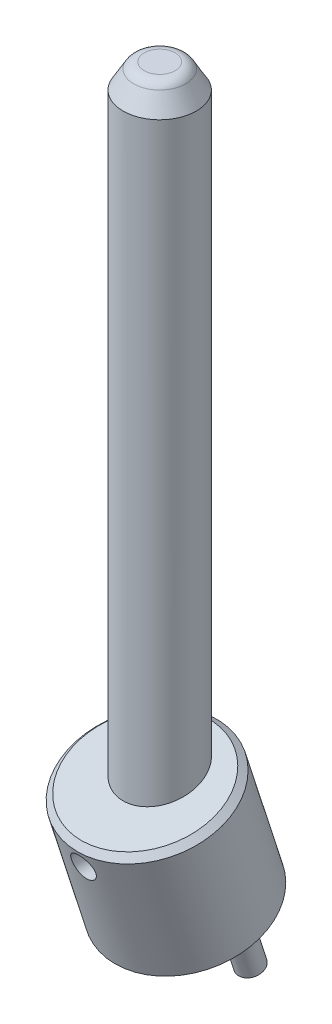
ISO-10303-21;
HEADER;
FILE_DESCRIPTION(('STEP AP214'),'2;1');
FILE_NAME('part.step','',(''),(''),'','','');
FILE_SCHEMA(('AUTOMOTIVE_DESIGN { 1 0 10303 214 1 1 1 1 }'));
ENDSEC;
DATA;
#1=APPLICATION_CONTEXT('core data for automotive mechanical design processes');
#2=APPLICATION_PROTOCOL_DEFINITION('international standard','automotive_design',2000,#1);
#3=PRODUCT_CONTEXT('',#1,'mechanical');
#4=PRODUCT('Part','Part','',(#3));
#5=PRODUCT_RELATED_PRODUCT_CATEGORY('part','',(#4));
#6=PRODUCT_DEFINITION_FORMATION('','',#4);
#7=PRODUCT_DEFINITION_CONTEXT('part definition',#1,'design');
#8=PRODUCT_DEFINITION('design','',#6,#7);
#9=PRODUCT_DEFINITION_SHAPE('','',#8);
#10=(LENGTH_UNIT() NAMED_UNIT(*) SI_UNIT(.MILLI.,.METRE.));
#11=(NAMED_UNIT(*) PLANE_ANGLE_UNIT() SI_UNIT($,.RADIAN.));
#12=(NAMED_UNIT(*) SI_UNIT($,.STERADIAN.) SOLID_ANGLE_UNIT());
#13=UNCERTAINTY_MEASURE_WITH_UNIT(LENGTH_MEASURE(1.E-05),#10,'distance_accuracy_value','');
#14=(GEOMETRIC_REPRESENTATION_CONTEXT(3) GLOBAL_UNCERTAINTY_ASSIGNED_CONTEXT((#13)) GLOBAL_UNIT_ASSIGNED_CONTEXT((#10,
#11,#12)) REPRESENTATION_CONTEXT('',''));
#15=CARTESIAN_POINT('',(0.,0.,0.));
#16=DIRECTION('',(0.,0.,1.));
#17=DIRECTION('',(1.,0.,0.));
#18=AXIS2_PLACEMENT_3D('',#15,#16,#17);
#19=CARTESIAN_POINT('',(0.,-9.40212494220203,-6.27483455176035));
#20=DIRECTION('',(0.,-0.951056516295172,-0.309016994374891));
#21=DIRECTION('',(0.,0.309016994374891,-0.951056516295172));
#22=AXIS2_PLACEMENT_3D('',#19,#20,#21);
#23=PLANE('',#22);
#24=CARTESIAN_POINT('',(-8.75,-9.40212494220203,-6.27483455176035));
#25=DIRECTION('',(0.,-0.951056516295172,-0.309016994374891));
#26=DIRECTION('',(0.,0.309016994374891,-0.951056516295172));
#27=AXIS2_PLACEMENT_3D('',#24,#25,#26);
#28=CIRCLE('',#27,1.49996275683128);
#29=CARTESIAN_POINT('',(-8.75,-8.93861095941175,-7.70138390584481));
#30=VERTEX_POINT('',#29);
#31=EDGE_CURVE('P0_E17',#30,#30,#28,.F.);
#32=ORIENTED_EDGE('',*,*,#31,.F.);
#33=EDGE_LOOP('',(#32));
#34=FACE_BOUND('',#33,.T.);
#35=ADVANCED_FACE('P0_F14',(#34),#23,.T.);
#36=CARTESIAN_POINT('',(0.,-9.40212494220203,-6.27483455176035));
#37=DIRECTION('',(0.,-0.951056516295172,-0.309016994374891));
#38=DIRECTION('',(0.,0.309016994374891,-0.951056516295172));
#39=AXIS2_PLACEMENT_3D('',#36,#37,#38);
#40=PLANE('',#39);
#41=CARTESIAN_POINT('',(8.75,-9.40212494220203,-6.27483455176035));
#42=DIRECTION('',(0.,-0.951056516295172,-0.309016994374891));
#43=DIRECTION('',(0.,0.309016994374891,-0.951056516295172));
#44=AXIS2_PLACEMENT_3D('',#41,#42,#43);
#45=CIRCLE('',#44,1.49996275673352);
#46=CARTESIAN_POINT('',(8.75,-8.93861095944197,-7.70138390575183));
#47=VERTEX_POINT('',#46);
#48=EDGE_CURVE('P0_E114',#47,#47,#45,.F.);
#49=ORIENTED_EDGE('',*,*,#48,.F.);
#50=EDGE_LOOP('',(#49));
#51=FACE_BOUND('',#50,.T.);
#52=ADVANCED_FACE('P0_F104',(#51),#40,.T.);
#53=CARTESIAN_POINT('',(0.,-1.96891114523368E-13,-3.84241249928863E-13));
#54=DIRECTION('',(0.,-1.,0.));
#55=DIRECTION('',(0.,0.,-1.));
#56=AXIS2_PLACEMENT_3D('',#53,#54,#55);
#57=PLANE('',#56);
#58=CARTESIAN_POINT('',(0.,1.21430643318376E-13,-2.23172175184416E-12));
#59=DIRECTION('',(0.,-1.,0.));
#60=DIRECTION('',(0.,0.,-1.));
#61=AXIS2_PLACEMENT_3D('',#58,#59,#60);
#62=CIRCLE('',#61,6.);
#63=CARTESIAN_POINT('',(0.,1.21430643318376E-13,-6.00000000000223));
#64=VERTEX_POINT('',#63);
#65=EDGE_CURVE('P0_E116',#64,#64,#62,.F.);
#66=ORIENTED_EDGE('',*,*,#65,.T.);
#67=EDGE_LOOP('',(#66));
#68=FACE_BOUND('',#67,.T.);
#69=ADVANCED_FACE('P0_F101',(#68),#57,.F.);
#70=CARTESIAN_POINT('',(-8.75,-8.92656978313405,-6.12031731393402));
#71=DIRECTION('',(0.,0.951056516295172,0.309016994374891));
#72=DIRECTION('',(0.,-0.309016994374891,0.951056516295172));
#73=AXIS2_PLACEMENT_3D('',#70,#71,#72);
#74=CONICAL_SURFACE('',#73,1.99997862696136,0.785385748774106);
#75=CARTESIAN_POINT('',(-8.75,-8.92654945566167,-6.12031070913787));
#76=DIRECTION('',(0.,0.951056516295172,0.309016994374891));
#77=DIRECTION('',(0.,-0.309016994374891,0.951056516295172));
#78=AXIS2_PLACEMENT_3D('',#75,#76,#77);
#79=CIRCLE('',#78,2.);
#80=CARTESIAN_POINT('',(-8.75,-9.54458344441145,-4.21819767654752));
#81=VERTEX_POINT('',#80);
#82=EDGE_CURVE('P0_E118',#81,#81,#79,.T.);
#83=ORIENTED_EDGE('',*,*,#82,.F.);
#84=EDGE_LOOP('',(#83));
#85=FACE_BOUND('',#84,.T.);
#86=ORIENTED_EDGE('',*,*,#31,.T.);
#87=EDGE_LOOP('',(#86));
#88=FACE_BOUND('',#87,.T.);
#89=ADVANCED_FACE('P0_F97',(#85,#88),#74,.T.);
#90=CARTESIAN_POINT('',(8.75,-8.92656978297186,-6.12031731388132));
#91=DIRECTION('',(0.,0.951056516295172,0.309016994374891));
#92=DIRECTION('',(0.,-0.309016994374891,0.951056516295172));
#93=AXIS2_PLACEMENT_3D('',#90,#91,#92);
#94=CONICAL_SURFACE('',#93,1.99997862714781,0.785385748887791);
#95=CARTESIAN_POINT('',(8.75,-8.92654945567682,-6.12031070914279));
#96=DIRECTION('',(0.,0.951056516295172,0.309016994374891));
#97=DIRECTION('',(0.,-0.309016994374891,0.951056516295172));
#98=AXIS2_PLACEMENT_3D('',#95,#96,#97);
#99=CIRCLE('',#98,2.);
#100=CARTESIAN_POINT('',(8.75,-9.5445834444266,-4.21819767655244));
#101=VERTEX_POINT('',#100);
#102=EDGE_CURVE('P0_E123',#101,#101,#99,.T.);
#103=ORIENTED_EDGE('',*,*,#102,.F.);
#104=EDGE_LOOP('',(#103));
#105=FACE_BOUND('',#104,.T.);
#106=ORIENTED_EDGE('',*,*,#48,.T.);
#107=EDGE_LOOP('',(#106));
#108=FACE_BOUND('',#107,.T.);
#109=ADVANCED_FACE('P0_F92',(#105,#108),#94,.T.);
#110=CARTESIAN_POINT('',(0.,22.9396913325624,-2.23345647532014E-12));
#111=DIRECTION('',(0.,-1.,0.));
#112=DIRECTION('',(0.,0.,-1.));
#113=AXIS2_PLACEMENT_3D('',#110,#111,#112);
#114=CYLINDRICAL_SURFACE('',#113,6.);
#115=CARTESIAN_POINT('',(0.,18.0000000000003,-2.23345647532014E-12));
#116=DIRECTION('',(0.,0.951056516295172,0.309016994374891));
#117=DIRECTION('',(0.,-0.309016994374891,0.951056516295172));
#118=AXIS2_PLACEMENT_3D('',#115,#116,#117);
#119=ELLIPSE('',#118,6.30877334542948,6.);
#120=CARTESIAN_POINT('',(0.,16.0504818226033,5.99999999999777));
#121=VERTEX_POINT('',#120);
#122=EDGE_CURVE('P0_E79',#121,#121,#119,.F.);
#123=ORIENTED_EDGE('',*,*,#122,.F.);
#124=EDGE_LOOP('',(#123));
#125=FACE_BOUND('',#124,.T.);
#126=ORIENTED_EDGE('',*,*,#65,.F.);
#127=EDGE_LOOP('',(#126));
#128=FACE_BOUND('',#127,.T.);
#129=CARTESIAN_POINT('',(0.,11.9999999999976,5.99999999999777));
#130=CARTESIAN_POINT('',(-0.108974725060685,11.9999938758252,5.99999564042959));
#131=CARTESIAN_POINT('',(-0.218061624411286,11.9910518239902,5.99699891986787));
#132=CARTESIAN_POINT('',(-0.433135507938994,11.9555850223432,5.9853189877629));
#133=CARTESIAN_POINT('',(-0.539117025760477,11.9290310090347,5.97662631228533));
#134=CARTESIAN_POINT('',(-0.744677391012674,11.8593554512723,5.95450405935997));
#135=CARTESIAN_POINT('',(-0.844270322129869,11.816271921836,5.94108535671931));
#136=CARTESIAN_POINT('',(-1.03478027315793,11.7148991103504,5.91088362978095));
#137=CARTESIAN_POINT('',(-1.12569835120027,11.6566116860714,5.89410101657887));
#138=CARTESIAN_POINT('',(-1.29948066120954,11.5243501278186,5.85828234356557));
#139=CARTESIAN_POINT('',(-1.3820029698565,11.4499414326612,5.83919212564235));
#140=CARTESIAN_POINT('',(-1.53366185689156,11.2884702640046,5.80120729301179));
#141=CARTESIAN_POINT('',(-1.60279478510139,11.2014043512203,5.78231273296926));
#142=CARTESIAN_POINT('',(-1.72765000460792,11.0140295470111,5.74626660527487));
#143=CARTESIAN_POINT('',(-1.78292996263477,10.9134120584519,5.72918070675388));
#144=CARTESIAN_POINT('',(-1.87563792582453,10.7036473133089,5.69950605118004));
#145=CARTESIAN_POINT('',(-1.91307145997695,10.5945027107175,5.68691590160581));
#146=CARTESIAN_POINT('',(-1.96774691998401,10.3746535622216,5.66822606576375));
#147=CARTESIAN_POINT('',(-1.98562689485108,10.2641255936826,5.66192191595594));
#148=CARTESIAN_POINT('',(-2.00268224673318,10.0414725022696,5.65591313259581));
#149=CARTESIAN_POINT('',(-2.00186340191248,9.92934788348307,5.6562064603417));
#150=CARTESIAN_POINT('',(-1.98203983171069,9.71212698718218,5.66318029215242));
#151=CARTESIAN_POINT('',(-1.96386791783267,9.60694368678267,5.66956828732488));
#152=CARTESIAN_POINT('',(-1.9112124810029,9.40121363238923,5.68753310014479));
#153=CARTESIAN_POINT('',(-1.87672692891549,9.30066745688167,5.69911056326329));
#154=CARTESIAN_POINT('',(-1.79187699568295,9.10517186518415,5.72635859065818));
#155=CARTESIAN_POINT('',(-1.74126547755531,9.01033887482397,5.74209216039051));
#156=CARTESIAN_POINT('',(-1.62577463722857,8.83025359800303,5.77585213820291));
#157=CARTESIAN_POINT('',(-1.56089195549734,8.74500357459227,5.79387908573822));
#158=CARTESIAN_POINT('',(-1.41471183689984,8.58183112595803,5.83134330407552));
#159=CARTESIAN_POINT('',(-1.33273573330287,8.50452116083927,5.85080514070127));
#160=CARTESIAN_POINT('',(-1.15670996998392,8.36455883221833,5.88813263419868));
#161=CARTESIAN_POINT('',(-1.06265504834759,8.30191289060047,5.90599758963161));
#162=CARTESIAN_POINT('',(-0.863814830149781,8.19256071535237,5.93835612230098));
#163=CARTESIAN_POINT('',(-0.758926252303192,8.14603069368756,5.95281190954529));
#164=CARTESIAN_POINT('',(-0.542326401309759,8.07154393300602,5.9764270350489));
#165=CARTESIAN_POINT('',(-0.430629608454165,8.0435491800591,5.98559720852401));
#166=CARTESIAN_POINT('',(-0.264915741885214,8.01690889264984,5.99438078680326));
#167=CARTESIAN_POINT('',(-0.212162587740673,8.01057597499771,5.99648164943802));
#168=CARTESIAN_POINT('',(-0.106281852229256,8.00212003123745,5.99929232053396));
#169=CARTESIAN_POINT('',(-0.0531542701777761,7.99999701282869,6.00000212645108));
#170=CARTESIAN_POINT('',(0.108974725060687,8.00000612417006,5.99999564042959));
#171=CARTESIAN_POINT('',(0.218061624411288,8.00894817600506,5.99699891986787));
#172=CARTESIAN_POINT('',(0.433135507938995,8.0444149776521,5.9853189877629));
#173=CARTESIAN_POINT('',(0.539117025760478,8.07096899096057,5.97662631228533));
#174=CARTESIAN_POINT('',(0.744677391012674,8.14064454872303,5.95450405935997));
#175=CARTESIAN_POINT('',(0.844270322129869,8.18372807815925,5.94108535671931));
#176=CARTESIAN_POINT('',(1.03478027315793,8.28510088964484,5.91088362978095));
#177=CARTESIAN_POINT('',(1.12569835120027,8.34338831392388,5.89410101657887));
#178=CARTESIAN_POINT('',(1.29948066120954,8.47564987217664,5.85828234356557));
#179=CARTESIAN_POINT('',(1.3820029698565,8.55005856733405,5.83919212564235));
#180=CARTESIAN_POINT('',(1.53366185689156,8.71152973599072,5.80120729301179));
#181=CARTESIAN_POINT('',(1.60279478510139,8.79859564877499,5.78231273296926));
#182=CARTESIAN_POINT('',(1.72765000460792,8.98597045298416,5.74626660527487));
#183=CARTESIAN_POINT('',(1.78292996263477,9.08658794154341,5.72918070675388));
#184=CARTESIAN_POINT('',(1.87563792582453,9.29635268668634,5.69950605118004));
#185=CARTESIAN_POINT('',(1.91307145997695,9.40549728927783,5.68691590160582));
#186=CARTESIAN_POINT('',(1.96774691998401,9.6253464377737,5.66822606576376));
#187=CARTESIAN_POINT('',(1.98562689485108,9.73587440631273,5.66192191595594));
#188=CARTESIAN_POINT('',(2.00268224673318,9.95852749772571,5.65591313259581));
#189=CARTESIAN_POINT('',(2.00186340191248,10.0706521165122,5.6562064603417));
#190=CARTESIAN_POINT('',(1.98203983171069,10.2878730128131,5.66318029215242));
#191=CARTESIAN_POINT('',(1.96386791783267,10.3930563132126,5.66956828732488));
#192=CARTESIAN_POINT('',(1.9112124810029,10.5987863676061,5.68753310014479));
#193=CARTESIAN_POINT('',(1.87672692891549,10.6993325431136,5.69911056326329));
#194=CARTESIAN_POINT('',(1.79187699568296,10.8948281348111,5.72635859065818));
#195=CARTESIAN_POINT('',(1.74126547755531,10.9896611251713,5.74209216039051));
#196=CARTESIAN_POINT('',(1.62577463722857,11.1697464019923,5.77585213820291));
#197=CARTESIAN_POINT('',(1.56089195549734,11.254996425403,5.79387908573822));
#198=CARTESIAN_POINT('',(1.41471183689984,11.4181688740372,5.83134330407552));
#199=CARTESIAN_POINT('',(1.33273573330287,11.495478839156,5.85080514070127));
#200=CARTESIAN_POINT('',(1.15670996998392,11.635441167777,5.88813263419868));
#201=CARTESIAN_POINT('',(1.06265504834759,11.6980871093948,5.90599758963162));
#202=CARTESIAN_POINT('',(0.863814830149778,11.8074392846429,5.93835612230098));
#203=CARTESIAN_POINT('',(0.758926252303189,11.8539693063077,5.95281190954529));
#204=CARTESIAN_POINT('',(0.542326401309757,11.9284560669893,5.9764270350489));
#205=CARTESIAN_POINT('',(0.430629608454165,11.9564508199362,5.98559720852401));
#206=CARTESIAN_POINT('',(0.264915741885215,11.9830911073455,5.99438078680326));
#207=CARTESIAN_POINT('',(0.212162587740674,11.9894240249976,5.99648164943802));
#208=CARTESIAN_POINT('',(0.106281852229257,11.9978799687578,5.99929232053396));
#209=CARTESIAN_POINT('',(0.0531542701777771,12.0000029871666,6.00000212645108));
#210=CARTESIAN_POINT('',(0.,11.9999999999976,5.99999999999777));
#211=B_SPLINE_CURVE_WITH_KNOTS('',3,(#129,#130,#131,#132,#133,#134,#135,#136,#137,#138,#139,
#140,#141,#142,#143,#144,#145,#146,#147,#148,#149,#150,#151,#152,#153,#154,#155,#156,#157,#158,
#159,#160,#161,#162,#163,#164,#165,#166,#167,#168,#169,#170,#171,#172,#173,#174,#175,#176,#177,
#178,#179,#180,#181,#182,#183,#184,#185,#186,#187,#188,#189,#190,#191,#192,#193,#194,#195,#196,
#197,#198,#199,#200,#201,#202,#203,#204,#205,#206,#207,#208,#209,#210),.UNSPECIFIED.,.T.,.F.,(4,
2,2,2,2,2,2,2,2,2,2,2,2,2,2,2,2,2,2,2,2,2,2,2,2,2,2,2,2,2,2,2,2,2,2,2,2,2,2,2,4),(0.,
0.326719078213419,0.653982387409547,0.980497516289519,1.30697276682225,1.64368488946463,
1.98048867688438,2.32696849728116,2.67334090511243,3.00803851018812,3.34263269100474,
3.6619357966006,3.98127862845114,4.30577211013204,4.63034206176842,4.97180786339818,
5.31342292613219,5.65866330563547,6.00319342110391,6.16255590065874,6.32191867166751,
6.64863774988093,6.97590105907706,7.30241618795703,7.62889143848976,7.96560356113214,
8.3024073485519,8.64888716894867,8.99525957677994,9.32995718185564,9.66455136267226,
9.98385446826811,10.3031973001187,10.6276907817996,10.9522607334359,11.2937265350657,
11.6353415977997,11.980581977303,12.3251120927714,12.4844745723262,12.643837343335),.UNSPECIFIED.);
#212=CARTESIAN_POINT('',(0.,11.9999999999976,5.99999999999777));
#213=VERTEX_POINT('',#212);
#214=EDGE_CURVE('P0_E76',#213,#213,#211,.T.);
#215=ORIENTED_EDGE('',*,*,#214,.T.);
#216=EDGE_LOOP('',(#215));
#217=FACE_BOUND('',#216,.T.);
#218=ADVANCED_FACE('P0_F86',(#125,#128,#217),#114,.F.);
#219=CARTESIAN_POINT('',(-8.75,-3.695785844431,-4.420732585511));
#220=DIRECTION('',(0.,-0.951056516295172,-0.309016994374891));
#221=DIRECTION('',(0.,0.309016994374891,-0.951056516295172));
#222=AXIS2_PLACEMENT_3D('',#219,#220,#221);
#223=CYLINDRICAL_SURFACE('',#222,2.);
#224=CARTESIAN_POINT('',(-8.75,-3.695785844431,-4.420732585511));
#225=DIRECTION('',(0.,-0.951056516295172,-0.309016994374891));
#226=DIRECTION('',(0.,0.309016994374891,-0.951056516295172));
#227=AXIS2_PLACEMENT_3D('',#224,#225,#226);
#228=CIRCLE('',#227,2.);
#229=CARTESIAN_POINT('',(-8.75,-3.07775185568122,-6.32284561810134));
#230=VERTEX_POINT('',#229);
#231=EDGE_CURVE('P0_E72',#230,#230,#228,.T.);
#232=ORIENTED_EDGE('',*,*,#231,.T.);
#233=EDGE_LOOP('',(#232));
#234=FACE_BOUND('',#233,.T.);
#235=ORIENTED_EDGE('',*,*,#82,.T.);
#236=EDGE_LOOP('',(#235));
#237=FACE_BOUND('',#236,.T.);
#238=ADVANCED_FACE('P0_F91',(#234,#237),#223,.T.);
#239=CARTESIAN_POINT('',(8.75,-3.695785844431,-4.420732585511));
#240=DIRECTION('',(0.,-0.951056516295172,-0.309016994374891));
#241=DIRECTION('',(0.,0.309016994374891,-0.951056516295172));
#242=AXIS2_PLACEMENT_3D('',#239,#240,#241);
#243=CYLINDRICAL_SURFACE('',#242,2.);
#244=CARTESIAN_POINT('',(8.75,-3.695785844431,-4.420732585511));
#245=DIRECTION('',(0.,-0.951056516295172,-0.309016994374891));
#246=DIRECTION('',(0.,0.309016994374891,-0.951056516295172));
#247=AXIS2_PLACEMENT_3D('',#244,#245,#246);
#248=CIRCLE('',#247,2.);
#249=CARTESIAN_POINT('',(8.75,-3.07775185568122,-6.32284561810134));
#250=VERTEX_POINT('',#249);
#251=EDGE_CURVE('P0_E68',#250,#250,#248,.T.);
#252=ORIENTED_EDGE('',*,*,#251,.T.);
#253=EDGE_LOOP('',(#252));
#254=FACE_BOUND('',#253,.T.);
#255=ORIENTED_EDGE('',*,*,#102,.T.);
#256=EDGE_LOOP('',(#255));
#257=FACE_BOUND('',#256,.T.);
#258=ADVANCED_FACE('P0_F139',(#254,#257),#243,.T.);
#259=CARTESIAN_POINT('',(0.,17.2274575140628,2.3776412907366));
#260=DIRECTION('',(0.,0.951056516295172,0.309016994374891));
#261=DIRECTION('',(0.,-0.309016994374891,0.951056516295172));
#262=AXIS2_PLACEMENT_3D('',#259,#260,#261);
#263=PLANE('',#262);
#264=ORIENTED_EDGE('',*,*,#122,.T.);
#265=EDGE_LOOP('',(#264));
#266=FACE_BOUND('',#265,.T.);
#267=CARTESIAN_POINT('',(0.,17.2274575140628,2.37764129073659));
#268=DIRECTION('',(0.,0.951056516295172,0.309016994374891));
#269=DIRECTION('',(0.,-0.309016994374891,0.951056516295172));
#270=AXIS2_PLACEMENT_3D('',#267,#268,#269);
#271=CIRCLE('',#270,11.0000028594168);
#272=CARTESIAN_POINT('',(0.,13.8282696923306,12.8392656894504));
#273=VERTEX_POINT('',#272);
#274=EDGE_CURVE('P0_E38',#273,#273,#271,.F.);
#275=ORIENTED_EDGE('',*,*,#274,.F.);
#276=EDGE_LOOP('',(#275));
#277=FACE_BOUND('',#276,.T.);
#278=ADVANCED_FACE('P0_F63',(#266,#277),#263,.T.);
#279=CARTESIAN_POINT('',(0.,9.99999999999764,-3.26463648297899));
#280=DIRECTION('',(0.,0.,1.));
#281=DIRECTION('',(0.,-1.,0.));
#282=AXIS2_PLACEMENT_3D('',#279,#280,#281);
#283=CYLINDRICAL_SURFACE('',#282,2.);
#284=ORIENTED_EDGE('',*,*,#214,.F.);
#285=EDGE_LOOP('',(#284));
#286=FACE_BOUND('',#285,.T.);
#287=CARTESIAN_POINT('',(0.,7.99999999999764,11.9970052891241));
#288=CARTESIAN_POINT('',(-0.111039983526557,8.00000515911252,11.9970046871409));
#289=CARTESIAN_POINT('',(-0.222212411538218,8.00928490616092,11.9983836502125));
#290=CARTESIAN_POINT('',(-0.441548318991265,8.04617179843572,12.0039929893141));
#291=CARTESIAN_POINT('',(-0.549705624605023,8.07381402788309,12.0082288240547));
#292=CARTESIAN_POINT('',(-0.759721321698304,8.14658267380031,12.0198059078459));
#293=CARTESIAN_POINT('',(-0.861584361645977,8.19169600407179,12.0271448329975));
#294=CARTESIAN_POINT('',(-1.05614706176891,8.29798973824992,12.0452836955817));
#295=CARTESIAN_POINT('',(-1.14885077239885,8.35916299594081,12.0560820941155));
#296=CARTESIAN_POINT('',(-1.32261776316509,8.49570691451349,12.0815339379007));
#297=CARTESIAN_POINT('',(-1.40367423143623,8.57108582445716,12.0961896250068));
#298=CARTESIAN_POINT('',(-1.5519110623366,8.73363764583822,12.129665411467));
#299=CARTESIAN_POINT('',(-1.6190904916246,8.82081134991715,12.1484857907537));
#300=CARTESIAN_POINT('',(-1.73837000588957,9.00491642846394,12.1905893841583));
#301=CARTESIAN_POINT('',(-1.7903522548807,9.10191658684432,12.2139052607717));
#302=CARTESIAN_POINT('',(-1.87747856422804,9.30214573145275,12.2647975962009));
#303=CARTESIAN_POINT('',(-1.9126210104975,9.4053753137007,12.2923744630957));
#304=CARTESIAN_POINT('',(-1.96629975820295,9.61790464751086,12.3521882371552));
#305=CARTESIAN_POINT('',(-1.98436755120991,9.72729288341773,12.3845299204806));
#306=CARTESIAN_POINT('',(-2.00230932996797,9.94650556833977,12.4525782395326));
#307=CARTESIAN_POINT('',(-2.00217894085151,10.0563301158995,12.4882856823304));
#308=CARTESIAN_POINT('',(-1.98374587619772,10.2789777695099,12.563893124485));
#309=CARTESIAN_POINT('',(-1.96456018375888,10.3916871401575,12.6039125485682));
#310=CARTESIAN_POINT('',(-1.90751930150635,10.6118069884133,12.6852377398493));
#311=CARTESIAN_POINT('',(-1.86965809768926,10.7192157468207,12.7265439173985));
#312=CARTESIAN_POINT('',(-1.77413776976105,10.9308684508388,12.8107504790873));
#313=CARTESIAN_POINT('',(-1.71566059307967,11.0347494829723,12.8536384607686));
#314=CARTESIAN_POINT('',(-1.58066769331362,11.2311322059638,12.9371273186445));
#315=CARTESIAN_POINT('',(-1.50415049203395,11.3236329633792,12.977728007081));
#316=CARTESIAN_POINT('',(-1.3352306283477,11.4937977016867,13.0541740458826));
#317=CARTESIAN_POINT('',(-1.24294045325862,11.5715590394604,13.0900500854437));
#318=CARTESIAN_POINT('',(-1.04417860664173,11.7100695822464,13.1550581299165));
#319=CARTESIAN_POINT('',(-0.937708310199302,11.7708204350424,13.1841907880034));
#320=CARTESIAN_POINT('',(-0.722610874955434,11.8683322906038,13.2314743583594));
#321=CARTESIAN_POINT('',(-0.614823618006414,11.9066131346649,13.2503126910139));
#322=CARTESIAN_POINT('',(-0.39334350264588,11.9642523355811,13.2788225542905));
#323=CARTESIAN_POINT('',(-0.279670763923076,11.983671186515,13.2885233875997));
#324=CARTESIAN_POINT('',(-0.137726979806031,11.9954442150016,13.294406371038));
#325=CARTESIAN_POINT('',(-0.110219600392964,11.9971508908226,13.2952593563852));
#326=CARTESIAN_POINT('',(-0.0551452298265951,11.9994294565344,13.2963986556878));
#327=CARTESIAN_POINT('',(-0.0275782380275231,12.0000013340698,13.2966849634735));
#328=CARTESIAN_POINT('',(0.104240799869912,11.9999949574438,13.2966807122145));
#329=CARTESIAN_POINT('',(0.208642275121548,11.99180041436,13.2925741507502));
#330=CARTESIAN_POINT('',(0.414435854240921,11.959373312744,13.2764236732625));
#331=CARTESIAN_POINT('',(0.51582026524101,11.9351029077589,13.2643610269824));
#332=CARTESIAN_POINT('',(0.712264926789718,11.8717076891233,13.2331767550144));
#333=CARTESIAN_POINT('',(0.807346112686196,11.8326352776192,13.2140800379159));
#334=CARTESIAN_POINT('',(0.989294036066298,11.7411700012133,13.1700007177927));
#335=CARTESIAN_POINT('',(1.07616291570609,11.6887806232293,13.1450196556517));
#336=CARTESIAN_POINT('',(1.24423136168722,11.56940848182,13.0890989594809));
#337=CARTESIAN_POINT('',(1.32492107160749,11.5018210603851,13.0579216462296));
#338=CARTESIAN_POINT('',(1.47406553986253,11.3557432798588,12.9920445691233));
#339=CARTESIAN_POINT('',(1.54251476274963,11.2772480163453,12.9573432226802));
#340=CARTESIAN_POINT('',(1.67207008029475,11.1032022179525,12.8824163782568));
#341=CARTESIAN_POINT('',(1.73182803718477,11.0067366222,12.8419810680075));
#342=CARTESIAN_POINT('',(1.83416867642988,10.8053526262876,12.7603799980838));
#343=CARTESIAN_POINT('',(1.87674509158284,10.7004311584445,12.7192139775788));
#344=CARTESIAN_POINT('',(1.94551863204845,10.4786944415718,12.6355089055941));
#345=CARTESIAN_POINT('',(1.97069592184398,10.36154260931,12.5930174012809));
#346=CARTESIAN_POINT('',(1.9997598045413,10.1237215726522,12.5106190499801));
#347=CARTESIAN_POINT('',(2.00364745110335,10.0030525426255,12.4707120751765));
#348=CARTESIAN_POINT('',(1.98953422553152,9.76348808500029,12.3953767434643));
#349=CARTESIAN_POINT('',(1.97184926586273,9.64459225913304,12.3598919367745));
#350=CARTESIAN_POINT('',(1.91498307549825,9.41066737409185,12.2936977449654));
#351=CARTESIAN_POINT('',(1.87580886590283,9.29563706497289,12.262986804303));
#352=CARTESIAN_POINT('',(1.77922993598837,9.07933027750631,12.2083390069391));
#353=CARTESIAN_POINT('',(1.72288335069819,8.97764930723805,12.1841322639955));
#354=CARTESIAN_POINT('',(1.59282108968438,8.78491821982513,12.1405846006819));
#355=CARTESIAN_POINT('',(1.51911087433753,8.6938647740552,12.1212421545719));
#356=CARTESIAN_POINT('',(1.35980313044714,8.52910853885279,12.0879233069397));
#357=CARTESIAN_POINT('',(1.27482793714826,8.45484139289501,12.0737570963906));
#358=CARTESIAN_POINT('',(1.09318668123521,8.32141749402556,12.0493401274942));
#359=CARTESIAN_POINT('',(0.996516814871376,8.26226567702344,12.039090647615));
#360=CARTESIAN_POINT('',(0.795918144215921,8.16181771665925,12.0222362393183));
#361=CARTESIAN_POINT('',(0.692124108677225,8.12026053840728,12.0155775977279));
#362=CARTESIAN_POINT('',(0.479062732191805,8.05504058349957,12.0053266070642));
#363=CARTESIAN_POINT('',(0.369806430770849,8.03134315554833,12.0017283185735));
#364=CARTESIAN_POINT('',(0.216442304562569,8.011271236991,11.9986968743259));
#365=CARTESIAN_POINT('',(0.173270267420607,8.00704808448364,11.9980619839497));
#366=CARTESIAN_POINT('',(0.086738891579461,8.00141145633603,11.9972163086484));
#367=CARTESIAN_POINT('',(0.0433795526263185,7.99999798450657,11.9970055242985));
#368=CARTESIAN_POINT('',(0.,7.99999999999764,11.9970052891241));
#369=B_SPLINE_CURVE_WITH_KNOTS('',3,(#287,#288,#289,#290,#291,#292,#293,#294,#295,#296,#297,
#298,#299,#300,#301,#302,#303,#304,#305,#306,#307,#308,#309,#310,#311,#312,#313,#314,#315,#316,
#317,#318,#319,#320,#321,#322,#323,#324,#325,#326,#327,#328,#329,#330,#331,#332,#333,#334,#335,
#336,#337,#338,#339,#340,#341,#342,#343,#344,#345,#346,#347,#348,#349,#350,#351,#352,#353,#354,
#355,#356,#357,#358,#359,#360,#361,#362,#363,#364,#365,#366,#367,#368),.UNSPECIFIED.,.T.,.F.,(4,
2,2,2,2,2,2,2,2,2,2,2,2,2,2,2,2,2,2,2,2,2,2,2,2,2,2,2,2,2,2,2,2,2,2,2,2,2,2,2,4),(0.,
0.332956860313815,0.666551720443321,0.999897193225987,1.33309458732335,1.6664860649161,
1.99989995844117,2.33583439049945,2.67180101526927,3.01673925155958,3.36176041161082,
3.72355248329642,4.08546113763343,4.46373996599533,4.84204980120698,5.21776639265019,
5.59344657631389,5.93934899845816,6.28413834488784,6.36684210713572,6.44954676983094,
6.76215558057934,7.07550297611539,7.38775126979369,7.69991788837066,8.02789251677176,
8.35601509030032,8.71583515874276,9.07578635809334,9.45536691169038,9.83492867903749,
10.2089981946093,10.5829455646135,10.9373769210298,11.2916969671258,11.6312721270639,
11.9709580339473,12.3054109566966,12.6392132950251,12.7692880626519,12.8993630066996),.UNSPECIFIED.);
#370=CARTESIAN_POINT('',(0.,7.99999999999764,11.9970052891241));
#371=VERTEX_POINT('',#370);
#372=EDGE_CURVE('P0_E31',#371,#371,#369,.T.);
#373=ORIENTED_EDGE('',*,*,#372,.F.);
#374=EDGE_LOOP('',(#373));
#375=FACE_BOUND('',#374,.T.);
#376=ADVANCED_FACE('P0_F40',(#286,#375),#283,.F.);
#377=CARTESIAN_POINT('',(0.,-3.695785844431,-4.420732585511));
#378=DIRECTION('',(0.,0.951056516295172,0.309016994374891));
#379=DIRECTION('',(0.,-0.309016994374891,0.951056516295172));
#380=AXIS2_PLACEMENT_3D('',#377,#378,#379);
#381=PLANE('',#380);
#382=ORIENTED_EDGE('',*,*,#251,.F.);
#383=EDGE_LOOP('',(#382));
#384=FACE_BOUND('',#383,.T.);
#385=ORIENTED_EDGE('',*,*,#231,.F.);
#386=EDGE_LOOP('',(#385));
#387=FACE_BOUND('',#386,.T.);
#388=CARTESIAN_POINT('',(0.,-3.695785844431,-4.420732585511));
#389=DIRECTION('',(0.,0.951056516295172,0.309016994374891));
#390=DIRECTION('',(0.,-0.309016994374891,0.951056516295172));
#391=AXIS2_PLACEMENT_3D('',#388,#389,#390);
#392=CIRCLE('',#391,11.0000032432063);
#393=CARTESIAN_POINT('',(0.,-7.09497378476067,6.04089217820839));
#394=VERTEX_POINT('',#393);
#395=EDGE_CURVE('P0_E26',#394,#394,#392,.T.);
#396=ORIENTED_EDGE('',*,*,#395,.F.);
#397=EDGE_LOOP('',(#396));
#398=FACE_BOUND('',#397,.T.);
#399=ADVANCED_FACE('P0_F55',(#384,#387,#398),#381,.F.);
#400=CARTESIAN_POINT('',(0.,16.2764016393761,2.06862450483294));
#401=DIRECTION('',(0.,-0.951056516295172,-0.309016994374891));
#402=DIRECTION('',(0.,0.309016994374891,-0.951056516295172));
#403=AXIS2_PLACEMENT_3D('',#400,#401,#402);
#404=CONICAL_SURFACE('',#403,12.0000024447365,0.785398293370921);
#405=ORIENTED_EDGE('',*,*,#274,.T.);
#406=EDGE_LOOP('',(#405));
#407=FACE_BOUND('',#406,.T.);
#408=CARTESIAN_POINT('',(0.,16.276399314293,2.06862374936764));
#409=DIRECTION('',(0.,0.951056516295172,0.309016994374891));
#410=DIRECTION('',(0.,-0.309016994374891,0.951056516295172));
#411=AXIS2_PLACEMENT_3D('',#408,#409,#410);
#412=CIRCLE('',#411,12.);
#413=CARTESIAN_POINT('',(0.,12.5681953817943,13.4813019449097));
#414=VERTEX_POINT('',#413);
#415=EDGE_CURVE('P0_E21',#414,#414,#412,.F.);
#416=ORIENTED_EDGE('',*,*,#415,.F.);
#417=EDGE_LOOP('',(#416));
#418=FACE_BOUND('',#417,.T.);
#419=ADVANCED_FACE('P0_F52',(#407,#418),#404,.T.);
#420=CARTESIAN_POINT('',(0.,-2.74472997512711,-4.11171580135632));
#421=DIRECTION('',(0.,0.951056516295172,0.309016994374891));
#422=DIRECTION('',(0.,-0.309016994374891,0.951056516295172));
#423=AXIS2_PLACEMENT_3D('',#420,#421,#422);
#424=CONICAL_SURFACE('',#423,12.000002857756,0.785398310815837);
#425=CARTESIAN_POINT('',(0.,-2.7447272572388,-4.11171491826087));
#426=DIRECTION('',(0.,0.951056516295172,0.309016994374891));
#427=DIRECTION('',(0.,-0.309016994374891,0.951056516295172));
#428=AXIS2_PLACEMENT_3D('',#425,#426,#427);
#429=CIRCLE('',#428,12.);
#430=CARTESIAN_POINT('',(0.,-6.45293118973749,7.30096327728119));
#431=VERTEX_POINT('',#430);
#432=EDGE_CURVE('P0_E9',#431,#431,#429,.T.);
#433=ORIENTED_EDGE('',*,*,#432,.F.);
#434=EDGE_LOOP('',(#433));
#435=FACE_BOUND('',#434,.T.);
#436=ORIENTED_EDGE('',*,*,#395,.T.);
#437=EDGE_LOOP('',(#436));
#438=FACE_BOUND('',#437,.T.);
#439=ADVANCED_FACE('P0_F48',(#435,#438),#424,.T.);
#440=CARTESIAN_POINT('',(0.,-4.74194801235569,-4.76065127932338));
#441=DIRECTION('',(0.,0.951056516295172,0.309016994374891));
#442=DIRECTION('',(0.,-0.309016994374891,0.951056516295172));
#443=AXIS2_PLACEMENT_3D('',#440,#441,#442);
#444=CYLINDRICAL_SURFACE('',#443,12.);
#445=ORIENTED_EDGE('',*,*,#415,.T.);
#446=EDGE_LOOP('',(#445));
#447=FACE_BOUND('',#446,.T.);
#448=ORIENTED_EDGE('',*,*,#432,.T.);
#449=EDGE_LOOP('',(#448));
#450=FACE_BOUND('',#449,.T.);
#451=ORIENTED_EDGE('',*,*,#372,.T.);
#452=EDGE_LOOP('',(#451));
#453=FACE_BOUND('',#452,.T.);
#454=ADVANCED_FACE('P0_F44',(#447,#450,#453),#444,.T.);
#455=CLOSED_SHELL('',(#35,#52,#69,#89,#109,#218,#238,#258,#278,#376,#399,#419,#439,#454));
#456=MANIFOLD_SOLID_BREP('P0_B1',#455);
#457=CARTESIAN_POINT('',(0.,118.,0.));
#458=DIRECTION('',(0.,1.,0.));
#459=DIRECTION('',(-1.,0.,0.));
#460=AXIS2_PLACEMENT_3D('',#457,#458,#459);
#461=PLANE('',#460);
#462=CARTESIAN_POINT('',(0.,118.,-2.535898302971));
#463=CARTESIAN_POINT('',(0.0368831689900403,118.,-2.53589885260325));
#464=CARTESIAN_POINT('',(0.0737662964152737,118.,-2.53509365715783));
#465=CARTESIAN_POINT('',(0.147462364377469,118.,-2.53187572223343));
#466=CARTESIAN_POINT('',(0.18427530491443,118.,-2.52946298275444));
#467=CARTESIAN_POINT('',(0.25776089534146,118.,-2.52303390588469));
#468=CARTESIAN_POINT('',(0.294433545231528,118.,-2.51901756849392));
#469=CARTESIAN_POINT('',(0.367568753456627,118.,-2.50938911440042));
#470=CARTESIAN_POINT('',(0.404031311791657,118.,-2.50377699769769));
#471=CARTESIAN_POINT('',(0.47667692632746,118.,-2.490967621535));
#472=CARTESIAN_POINT('',(0.512859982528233,118.,-2.48377036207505));
#473=CARTESIAN_POINT('',(0.584877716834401,118.,-2.46780441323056));
#474=CARTESIAN_POINT('',(0.620712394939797,118.,-2.45903572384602));
#475=CARTESIAN_POINT('',(0.691965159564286,118.,-2.4399436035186));
#476=CARTESIAN_POINT('',(0.727383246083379,118.,-2.42962017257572));
#477=CARTESIAN_POINT('',(0.797735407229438,118.,-2.4074382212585));
#478=CARTESIAN_POINT('',(0.832669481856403,118.,-2.39557970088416));
#479=CARTESIAN_POINT('',(0.901987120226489,118.,-2.37035014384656));
#480=CARTESIAN_POINT('',(0.93637068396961,118.,-2.35697910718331));
#481=CARTESIAN_POINT('',(1.00452184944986,118.,-2.32874997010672));
#482=CARTESIAN_POINT('',(1.03828945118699,118.,-2.31389186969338));
#483=CARTESIAN_POINT('',(1.10514441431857,118.,-2.28271688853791));
#484=CARTESIAN_POINT('',(1.13823177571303,118.,-2.26640000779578));
#485=CARTESIAN_POINT('',(1.20366327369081,118.,-2.23233852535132));
#486=CARTESIAN_POINT('',(1.23600741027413,118.,-2.21459392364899));
#487=CARTESIAN_POINT('',(1.29989089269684,118.,-2.17771077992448));
#488=CARTESIAN_POINT('',(1.33143023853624,118.,-2.1585722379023));
#489=CARTESIAN_POINT('',(1.39364409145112,118.,-2.11893763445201));
#490=CARTESIAN_POINT('',(1.4243185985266,118.,-2.0984415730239));
#491=CARTESIAN_POINT('',(1.48474442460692,118.,-2.05613098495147));
#492=CARTESIAN_POINT('',(1.51449574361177,118.,-2.03431645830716));
#493=CARTESIAN_POINT('',(1.57301840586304,118.,-1.98941032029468));
#494=CARTESIAN_POINT('',(1.60178974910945,117.999999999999,-1.96631870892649));
#495=CARTESIAN_POINT('',(1.65829826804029,118.000000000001,-1.91890289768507));
#496=CARTESIAN_POINT('',(1.68603544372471,118.000000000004,-1.89457869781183));
#497=CARTESIAN_POINT('',(1.74042067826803,117.999999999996,-1.84474199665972));
#498=CARTESIAN_POINT('',(1.76706873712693,117.999999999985,-1.81922949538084));
#499=CARTESIAN_POINT('',(1.82029256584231,118.000000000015,-1.76601289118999));
#500=CARTESIAN_POINT('',(1.84682142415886,118.000000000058,-1.73826186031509));
#501=CARTESIAN_POINT('',(1.89860821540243,117.999999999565,-1.68159728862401));
#502=CARTESIAN_POINT('',(1.92386612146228,117.999999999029,-1.65268372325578));
#503=CARTESIAN_POINT('',(1.97305870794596,117.999999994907,-1.59375026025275));
#504=CARTESIAN_POINT('',(1.99699333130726,117.999999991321,-1.56373031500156));
#505=CARTESIAN_POINT('',(2.04349107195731,117.999999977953,-1.50264173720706));
#506=CARTESIAN_POINT('',(2.06605409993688,117.999999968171,-1.47157303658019));
#507=CARTESIAN_POINT('',(2.09883857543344,117.999999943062,-1.42423762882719));
#508=CARTESIAN_POINT('',(2.10959069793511,117.999999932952,-1.40833607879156));
#509=CARTESIAN_POINT('',(2.13071680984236,117.999999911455,-1.37630625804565));
#510=CARTESIAN_POINT('',(2.14109116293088,117.99999990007,-1.36017822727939));
#511=CARTESIAN_POINT('',(2.17164317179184,117.999999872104,-1.31143484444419));
#512=CARTESIAN_POINT('',(2.19125045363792,117.999999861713,-1.27845922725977));
#513=CARTESIAN_POINT('',(2.22889471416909,117.99999986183,-1.21162642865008));
#514=CARTESIAN_POINT('',(2.24693169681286,117.999999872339,-1.17776924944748));
#515=CARTESIAN_POINT('',(2.28142652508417,117.999999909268,-1.10926021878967));
#516=CARTESIAN_POINT('',(2.2978844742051,117.999999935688,-1.07460841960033));
#517=CARTESIAN_POINT('',(2.32906359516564,117.999999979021,-1.00453892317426));
#518=CARTESIAN_POINT('',(2.343784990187,117.999999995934,-0.969121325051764));
#519=CARTESIAN_POINT('',(2.36475645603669,118.000000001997,-0.915929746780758));
#520=CARTESIAN_POINT('',(2.37150562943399,118.000000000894,-0.898347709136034));
#521=CARTESIAN_POINT('',(2.39938010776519,117.999999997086,-0.823272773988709));
#522=CARTESIAN_POINT('',(2.41865194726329,117.999999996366,-0.765068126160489));
#523=CARTESIAN_POINT('',(2.44418153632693,117.999999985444,-0.677429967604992));
#524=CARTESIAN_POINT('',(2.4520654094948,117.999999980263,-0.648455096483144));
#525=CARTESIAN_POINT('',(2.4678771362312,117.999999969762,-0.585935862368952));
#526=CARTESIAN_POINT('',(2.47563936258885,117.999999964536,-0.55234891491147));
#527=CARTESIAN_POINT('',(2.48574291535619,117.999999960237,-0.504089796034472));
#528=CARTESIAN_POINT('',(2.48865470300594,117.999999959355,-0.489534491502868));
#529=CARTESIAN_POINT('',(2.49475256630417,117.999999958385,-0.457572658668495));
#530=CARTESIAN_POINT('',(2.49788384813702,117.999999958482,-0.440155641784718));
#531=CARTESIAN_POINT('',(2.50672484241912,117.999999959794,-0.387811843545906));
#532=CARTESIAN_POINT('',(2.51188215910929,117.999999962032,-0.352790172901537));
#533=CARTESIAN_POINT('',(2.52071042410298,117.999999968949,-0.282561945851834));
#534=CARTESIAN_POINT('',(2.52438140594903,117.999999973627,-0.247355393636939));
#535=CARTESIAN_POINT('',(2.53023391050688,117.999999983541,-0.176819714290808));
#536=CARTESIAN_POINT('',(2.53241549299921,117.999999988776,-0.141490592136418));
#537=CARTESIAN_POINT('',(2.53527541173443,117.999999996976,-0.0707738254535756));
#538=CARTESIAN_POINT('',(2.53595383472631,117.999999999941,-0.0353861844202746));
#539=CARTESIAN_POINT('',(2.53584271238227,118.000000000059,0.0354236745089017));
#540=CARTESIAN_POINT('',(2.5350516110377,117.999999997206,0.0708458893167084));
#541=CARTESIAN_POINT('',(2.5320340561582,117.999999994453,0.141627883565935));
#542=CARTESIAN_POINT('',(2.52980764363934,117.999999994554,0.176987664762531));
#543=CARTESIAN_POINT('',(2.52391930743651,117.99999999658,0.2475885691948));
#544=CARTESIAN_POINT('',(2.52025735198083,117.999999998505,0.28282968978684));
#545=CARTESIAN_POINT('',(2.51148466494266,118.000000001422,0.353133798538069));
#546=CARTESIAN_POINT('',(2.50637382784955,118.000000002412,0.388196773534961));
#547=CARTESIAN_POINT('',(2.49768726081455,117.999999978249,0.440622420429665));
#548=CARTESIAN_POINT('',(2.49462143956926,117.999999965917,0.458070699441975));
#549=CARTESIAN_POINT('',(2.48998637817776,117.999999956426,0.482622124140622));
#550=CARTESIAN_POINT('',(2.48860039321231,117.999999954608,0.489759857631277));
#551=CARTESIAN_POINT('',(2.4808778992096,117.999999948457,0.528551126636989));
#552=CARTESIAN_POINT('',(2.47391140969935,117.999999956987,0.56008128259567));
#553=CARTESIAN_POINT('',(2.45703811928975,117.999999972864,0.630094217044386));
#554=CARTESIAN_POINT('',(2.44682378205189,117.999999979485,0.668502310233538));
#555=CARTESIAN_POINT('',(2.42009299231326,117.999999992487,0.760237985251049));
#556=CARTESIAN_POINT('',(2.40269884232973,117.999999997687,0.81331421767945));
#557=CARTESIAN_POINT('',(2.3753299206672,117.999999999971,0.888439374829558));
#558=CARTESIAN_POINT('',(2.36674512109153,117.999999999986,0.911006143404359));
#559=CARTESIAN_POINT('',(2.34370619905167,118.000000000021,0.969129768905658));
#560=CARTESIAN_POINT('',(2.32877604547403,118.000000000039,1.00450008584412));
#561=CARTESIAN_POINT('',(2.29733862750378,117.999999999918,1.0745319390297));
#562=CARTESIAN_POINT('',(2.2808313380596,117.999999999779,1.10919346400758));
#563=CARTESIAN_POINT('',(2.24628151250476,117.999999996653,1.17774451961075));
#564=CARTESIAN_POINT('',(2.22823891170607,117.999999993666,1.2116340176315));
#565=CARTESIAN_POINT('',(2.19064875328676,117.999999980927,1.27857233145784));
#566=CARTESIAN_POINT('',(2.1711010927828,117.999999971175,1.31162108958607));
#567=CARTESIAN_POINT('',(2.14068914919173,117.999999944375,1.36051430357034));
#568=CARTESIAN_POINT('',(2.13036938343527,117.999999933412,1.37669975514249));
#569=CARTESIAN_POINT('',(2.10937145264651,117.999999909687,1.40881381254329));
#570=CARTESIAN_POINT('',(2.09869365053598,117.999999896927,1.42474265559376));
#571=CARTESIAN_POINT('',(2.06610220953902,117.999999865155,1.4721471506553));
#572=CARTESIAN_POINT('',(2.04362999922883,117.999999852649,1.50324163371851));
#573=CARTESIAN_POINT('',(1.99724968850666,117.999999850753,1.56433741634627));
#574=CARTESIAN_POINT('',(1.9733415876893,117.999999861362,1.59433871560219));
#575=CARTESIAN_POINT('',(1.92416676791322,117.999999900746,1.65320597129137));
#576=CARTESIAN_POINT('',(1.89890013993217,117.99999992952,1.68207200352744));
#577=CARTESIAN_POINT('',(1.846969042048,117.999999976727,1.73850865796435));
#578=CARTESIAN_POINT('',(1.82030475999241,117.999999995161,1.76607945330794));
#579=CARTESIAN_POINT('',(1.77844405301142,118.000000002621,1.80781306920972));
#580=CARTESIAN_POINT('',(1.76359360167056,118.000000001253,1.82232876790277));
#581=CARTESIAN_POINT('',(1.70076531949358,117.999999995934,1.88227042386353));
#582=CARTESIAN_POINT('',(1.65118456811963,117.999999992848,1.92605591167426));
#583=CARTESIAN_POINT('',(1.57488305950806,117.999999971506,1.98829577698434));
#584=CARTESIAN_POINT('',(1.549391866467,117.999999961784,2.00828584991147));
#585=CARTESIAN_POINT('',(1.49369878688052,117.999999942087,2.0502411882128));
#586=CARTESIAN_POINT('',(1.46337191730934,117.999999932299,2.0720420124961));
#587=CARTESIAN_POINT('',(1.41924056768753,117.999999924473,2.10228129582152));
#588=CARTESIAN_POINT('',(1.40582015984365,117.99999992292,2.11128589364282));
#589=CARTESIAN_POINT('',(1.37628726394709,117.999999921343,2.13068691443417));
#590=CARTESIAN_POINT('',(1.36013949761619,117.999999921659,2.14102971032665));
#591=CARTESIAN_POINT('',(1.31134785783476,117.999999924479,2.1714986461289));
#592=CARTESIAN_POINT('',(1.27835328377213,117.999999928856,2.19106696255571));
#593=CARTESIAN_POINT('',(1.21150291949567,117.999999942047,2.22866697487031));
#594=CARTESIAN_POINT('',(1.17764715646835,117.999999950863,2.2466987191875));
#595=CARTESIAN_POINT('',(1.10914688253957,117.999999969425,2.28119222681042));
#596=CARTESIAN_POINT('',(1.07450241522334,117.999999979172,2.29765407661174));
#597=CARTESIAN_POINT('',(1.00449363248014,117.999999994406,2.3289604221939));
#598=CARTESIAN_POINT('',(0.969129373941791,117.999999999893,2.34380504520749));
#599=CARTESIAN_POINT('',(0.900489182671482,118.000000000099,2.37082263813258));
#600=CARTESIAN_POINT('',(0.867259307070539,117.999999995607,2.38311297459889));
#601=CARTESIAN_POINT('',(0.800333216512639,117.999999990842,2.40634607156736));
#602=CARTESIAN_POINT('',(0.766637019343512,117.99999999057,2.41728888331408));
#603=CARTESIAN_POINT('',(0.698829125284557,117.999999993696,2.43780460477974));
#604=CARTESIAN_POINT('',(0.664717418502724,117.999999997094,2.44737748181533));
#605=CARTESIAN_POINT('',(0.596126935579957,118.00000000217,2.46511836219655));
#606=CARTESIAN_POINT('',(0.561648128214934,118.000000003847,2.47328624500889));
#607=CARTESIAN_POINT('',(0.515953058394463,117.999999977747,2.48318600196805));
#608=CARTESIAN_POINT('',(0.504864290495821,117.999999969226,2.48551693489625));
#609=CARTESIAN_POINT('',(0.482616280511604,117.999999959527,2.4899893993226));
#610=CARTESIAN_POINT('',(0.471456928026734,117.999999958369,2.49213038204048));
#611=CARTESIAN_POINT('',(0.423172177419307,117.99999995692,2.50104303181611));
#612=CARTESIAN_POINT('',(0.385898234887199,117.999999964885,2.50702838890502));
#613=CARTESIAN_POINT('',(0.321772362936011,117.999999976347,2.51585848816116));
#614=CARTESIAN_POINT('',(0.294975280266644,117.99999998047,2.51911220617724));
#615=CARTESIAN_POINT('',(0.239190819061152,117.999999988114,2.52498123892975));
#616=CARTESIAN_POINT('',(0.210196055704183,117.999999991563,2.52752671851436));
#617=CARTESIAN_POINT('',(0.14428351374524,117.999999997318,2.53217246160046));
#618=CARTESIAN_POINT('',(0.107343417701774,117.999999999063,2.53396620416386));
#619=CARTESIAN_POINT('',(0.0598216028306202,117.999999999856,2.53524043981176));
#620=CARTESIAN_POINT('',(0.0492560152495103,117.999999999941,2.53545811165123));
#621=CARTESIAN_POINT('',(0.0257940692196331,118.000000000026,2.53580073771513));
#622=CARTESIAN_POINT('',(0.0128972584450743,118.000000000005,2.53589468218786));
#623=CARTESIAN_POINT('',(0.,118.,2.535898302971));
#624=B_SPLINE_CURVE_WITH_KNOTS('',3,(#462,#463,#464,#465,#466,#467,#468,#469,#470,#471,#472,
#473,#474,#475,#476,#477,#478,#479,#480,#481,#482,#483,#484,#485,#486,#487,#488,#489,#490,#491,
#492,#493,#494,#495,#496,#497,#498,#499,#500,#501,#502,#503,#504,#505,#506,#507,#508,#509,#510,
#511,#512,#513,#514,#515,#516,#517,#518,#519,#520,#521,#522,#523,#524,#525,#526,#527,#528,#529,
#530,#531,#532,#533,#534,#535,#536,#537,#538,#539,#540,#541,#542,#543,#544,#545,#546,#547,#548,
#549,#550,#551,#552,#553,#554,#555,#556,#557,#558,#559,#560,#561,#562,#563,#564,#565,#566,#567,
#568,#569,#570,#571,#572,#573,#574,#575,#576,#577,#578,#579,#580,#581,#582,#583,#584,#585,#586,
#587,#588,#589,#590,#591,#592,#593,#594,#595,#596,#597,#598,#599,#600,#601,#602,#603,#604,#605,
#606,#607,#608,#609,#610,#611,#612,#613,#614,#615,#616,#617,#618,#619,#620,#621,#622,#623),
.UNSPECIFIED.,.F.,.F.,(4,2,2,2,2,2,2,2,2,2,2,2,2,2,2,2,2,2,2,2,2,2,2,2,2,2,2,2,2,2,2,2,2,2,2,2,
2,2,2,2,2,2,2,2,2,2,2,2,2,2,2,2,2,2,2,2,2,2,2,2,2,2,2,2,2,2,2,2,2,2,2,2,2,2,2,2,2,2,2,2,4),(0.,
0.110640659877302,0.221281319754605,0.331921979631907,0.44256263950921,0.553203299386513,
0.663843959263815,0.774484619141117,0.88512527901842,0.995765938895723,1.10640659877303,
1.21704725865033,1.32768791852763,1.43832857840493,1.54896923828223,1.65960989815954,
1.77025055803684,1.88089121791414,1.99153187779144,2.10666707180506,2.22180469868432,
2.3369472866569,2.45209736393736,2.50967963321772,2.56720491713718,2.68225192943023,
2.7972986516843,2.91233782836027,3.02736220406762,3.08386093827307,3.2675950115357,
3.35766741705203,3.46104880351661,3.50557818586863,3.55866337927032,3.66482720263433,
3.7709886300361,3.87714579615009,3.98329683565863,4.08956033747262,4.19582080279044,
4.30208362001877,4.40835417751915,4.46149679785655,4.48330970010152,4.58015247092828,
4.69934377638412,4.86676228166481,4.93919015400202,5.05432496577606,5.16946160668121,
5.28460310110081,5.39975247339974,5.45733467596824,5.51486017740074,5.6299081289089,
5.7449561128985,5.85999640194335,5.97502126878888,6.03731998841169,6.23550765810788,
6.33267537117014,6.44467915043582,6.49316104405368,6.55068486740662,6.66572392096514,
6.78075934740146,6.89578843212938,7.01080846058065,7.11706929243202,7.22332608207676,
7.32958540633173,7.43585384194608,7.46984614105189,7.5039336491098,7.61714190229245,
7.69811150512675,7.78541397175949,7.89632392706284,7.92802695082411,7.96671751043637),.UNSPECIFIED.);
#625=CARTESIAN_POINT('',(0.,118.,-2.5358983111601));
#626=VERTEX_POINT('',#625);
#627=CARTESIAN_POINT('',(0.,118.,2.5358983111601));
#628=VERTEX_POINT('',#627);
#629=EDGE_CURVE('P1_E38',#626,#628,#624,.T.);
#630=ORIENTED_EDGE('',*,*,#629,.F.);
#631=CARTESIAN_POINT('',(0.,118.,0.));
#632=DIRECTION('',(0.,-1.,0.));
#633=DIRECTION('',(0.,0.,1.));
#634=AXIS2_PLACEMENT_3D('',#631,#632,#633);
#635=CIRCLE('',#634,2.535898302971);
#636=EDGE_CURVE('P1_E42',#628,#626,#635,.T.);
#637=ORIENTED_EDGE('',*,*,#636,.F.);
#638=EDGE_LOOP('',(#630,#637));
#639=FACE_BOUND('',#638,.T.);
#640=ADVANCED_FACE('P1_F17',(#639),#461,.T.);
#641=CARTESIAN_POINT('',(0.,116.,0.));
#642=DIRECTION('',(0.,1.,0.));
#643=DIRECTION('',(0.0152566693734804,0.,0.999883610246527));
#644=AXIS2_PLACEMENT_3D('',#641,#642,#643);
#645=TOROIDAL_SURFACE('',#644,2.535898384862,2.);
#646=ORIENTED_EDGE('',*,*,#629,.T.);
#647=ORIENTED_EDGE('',*,*,#636,.T.);
#648=EDGE_LOOP('',(#646,#647));
#649=FACE_BOUND('',#648,.T.);
#650=CARTESIAN_POINT('',(0.,117.000000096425,0.));
#651=DIRECTION('',(0.,-1.,0.));
#652=DIRECTION('',(0.,0.,1.));
#653=AXIS2_PLACEMENT_3D('',#650,#651,#652);
#654=CIRCLE('',#653,4.26794913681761);
#655=CARTESIAN_POINT('',(0.,117.000000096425,4.26794913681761));
#656=VERTEX_POINT('',#655);
#657=EDGE_CURVE('P1_E48',#656,#656,#654,.T.);
#658=ORIENTED_EDGE('',*,*,#657,.F.);
#659=EDGE_LOOP('',(#658));
#660=FACE_BOUND('',#659,.T.);
#661=ADVANCED_FACE('P1_F40',(#649,#660),#645,.T.);
#662=CARTESIAN_POINT('',(0.,0.,0.));
#663=DIRECTION('',(0.,1.,0.));
#664=DIRECTION('',(-1.,0.,0.));
#665=AXIS2_PLACEMENT_3D('',#662,#663,#664);
#666=PLANE('',#665);
#667=CARTESIAN_POINT('',(0.,-2.00088834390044E-08,0.));
#668=DIRECTION('',(0.,1.,0.));
#669=DIRECTION('',(-1.,0.,0.));
#670=AXIS2_PLACEMENT_3D('',#667,#668,#669);
#671=CIRCLE('',#670,4.99999913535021);
#672=CARTESIAN_POINT('',(-4.99999913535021,-2.00088834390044E-08,0.));
#673=VERTEX_POINT('',#672);
#674=EDGE_CURVE('P1_E85',#673,#673,#671,.T.);
#675=ORIENTED_EDGE('',*,*,#674,.F.);
#676=EDGE_LOOP('',(#675));
#677=FACE_BOUND('',#676,.T.);
#678=ADVANCED_FACE('P1_F76',(#677),#666,.F.);
#679=CARTESIAN_POINT('',(0.,10.,2.15470053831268));
#680=DIRECTION('',(0.,0.,1.));
#681=DIRECTION('',(0.,-1.,0.));
#682=AXIS2_PLACEMENT_3D('',#679,#680,#681);
#683=CONICAL_SURFACE('',#682,2.00000000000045,1.0471975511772);
#684=CARTESIAN_POINT('',(0.,9.99999999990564,0.99999999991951));
#685=VERTEX_POINT('',#684);
#686=VERTEX_LOOP('',#685);
#687=FACE_BOUND('',#686,.T.);
#688=CARTESIAN_POINT('',(0.,10.,2.154700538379));
#689=DIRECTION('',(0.,0.,1.));
#690=DIRECTION('',(0.,-1.,0.));
#691=AXIS2_PLACEMENT_3D('',#688,#689,#690);
#692=CIRCLE('',#691,2.);
#693=CARTESIAN_POINT('',(0.,8.,2.154700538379));
#694=VERTEX_POINT('',#693);
#695=EDGE_CURVE('P1_E82',#694,#694,#692,.T.);
#696=ORIENTED_EDGE('',*,*,#695,.T.);
#697=EDGE_LOOP('',(#696));
#698=FACE_BOUND('',#697,.T.);
#699=ADVANCED_FACE('P1_F116',(#687,#698),#683,.F.);
#700=CARTESIAN_POINT('',(0.,114.00000000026,0.));
#701=DIRECTION('',(0.,-1.,0.));
#702=DIRECTION('',(1.,0.,0.));
#703=AXIS2_PLACEMENT_3D('',#700,#701,#702);
#704=CONICAL_SURFACE('',#703,5.99999999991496,0.523598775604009);
#705=CARTESIAN_POINT('',(0.,114.,0.));
#706=DIRECTION('',(0.,1.,0.));
#707=DIRECTION('',(-1.,0.,0.));
#708=AXIS2_PLACEMENT_3D('',#705,#706,#707);
#709=CIRCLE('',#708,6.);
#710=CARTESIAN_POINT('',(-6.,114.,0.));
#711=VERTEX_POINT('',#710);
#712=EDGE_CURVE('P1_E92',#711,#711,#709,.F.);
#713=ORIENTED_EDGE('',*,*,#712,.F.);
#714=EDGE_LOOP('',(#713));
#715=FACE_BOUND('',#714,.T.);
#716=ORIENTED_EDGE('',*,*,#657,.T.);
#717=EDGE_LOOP('',(#716));
#718=FACE_BOUND('',#717,.T.);
#719=ADVANCED_FACE('P1_F108',(#715,#718),#704,.T.);
#720=CARTESIAN_POINT('',(0.,1.00000103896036,0.));
#721=DIRECTION('',(0.,1.,0.));
#722=DIRECTION('',(-1.,0.,0.));
#723=AXIS2_PLACEMENT_3D('',#720,#721,#722);
#724=CONICAL_SURFACE('',#723,6.00000002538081,0.78539807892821);
#725=CARTESIAN_POINT('',(0.,1.000001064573,0.));
#726=DIRECTION('',(0.,1.,0.));
#727=DIRECTION('',(-1.,0.,0.));
#728=AXIS2_PLACEMENT_3D('',#725,#726,#727);
#729=CIRCLE('',#728,6.);
#730=CARTESIAN_POINT('',(-6.,1.000001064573,0.));
#731=VERTEX_POINT('',#730);
#732=EDGE_CURVE('P1_E28',#731,#731,#729,.T.);
#733=ORIENTED_EDGE('',*,*,#732,.F.);
#734=EDGE_LOOP('',(#733));
#735=FACE_BOUND('',#734,.T.);
#736=ORIENTED_EDGE('',*,*,#674,.T.);
#737=EDGE_LOOP('',(#736));
#738=FACE_BOUND('',#737,.T.);
#739=ADVANCED_FACE('P1_F105',(#735,#738),#724,.T.);
#740=CARTESIAN_POINT('',(0.,10.,0.65));
#741=DIRECTION('',(0.,0.,1.));
#742=DIRECTION('',(0.,-1.,0.));
#743=AXIS2_PLACEMENT_3D('',#740,#741,#742);
#744=CYLINDRICAL_SURFACE('',#743,2.);
#745=ORIENTED_EDGE('',*,*,#695,.F.);
#746=EDGE_LOOP('',(#745));
#747=FACE_BOUND('',#746,.T.);
#748=CARTESIAN_POINT('',(0.,8.,6.));
#749=CARTESIAN_POINT('',(-0.108974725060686,8.00000612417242,5.99999564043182));
#750=CARTESIAN_POINT('',(-0.218061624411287,8.00894817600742,5.9969989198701));
#751=CARTESIAN_POINT('',(-0.433135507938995,8.04441497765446,5.98531898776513));
#752=CARTESIAN_POINT('',(-0.539117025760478,8.07096899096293,5.97662631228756));
#753=CARTESIAN_POINT('',(-0.744677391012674,8.14064454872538,5.9545040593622));
#754=CARTESIAN_POINT('',(-0.844270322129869,8.18372807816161,5.94108535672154));
#755=CARTESIAN_POINT('',(-1.03478027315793,8.2851008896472,5.91088362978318));
#756=CARTESIAN_POINT('',(-1.12569835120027,8.34338831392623,5.8941010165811));
#757=CARTESIAN_POINT('',(-1.29948066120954,8.475649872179,5.8582823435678));
#758=CARTESIAN_POINT('',(-1.3820029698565,8.55005856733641,5.83919212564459));
#759=CARTESIAN_POINT('',(-1.53366185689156,8.71152973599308,5.80120729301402));
#760=CARTESIAN_POINT('',(-1.60279478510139,8.79859564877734,5.78231273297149));
#761=CARTESIAN_POINT('',(-1.72765000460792,8.98597045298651,5.7462666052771));
#762=CARTESIAN_POINT('',(-1.78292996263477,9.08658794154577,5.72918070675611));
#763=CARTESIAN_POINT('',(-1.87563792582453,9.2963526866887,5.69950605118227));
#764=CARTESIAN_POINT('',(-1.91307145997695,9.40549728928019,5.68691590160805));
#765=CARTESIAN_POINT('',(-1.96774691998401,9.62534643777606,5.66822606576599));
#766=CARTESIAN_POINT('',(-1.98562689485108,9.73587440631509,5.66192191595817));
#767=CARTESIAN_POINT('',(-2.00268224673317,9.95852749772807,5.65591313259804));
#768=CARTESIAN_POINT('',(-2.00186340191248,10.0706521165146,5.65620646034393));
#769=CARTESIAN_POINT('',(-1.98203983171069,10.2878730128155,5.66318029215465));
#770=CARTESIAN_POINT('',(-1.96386791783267,10.393056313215,5.66956828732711));
#771=CARTESIAN_POINT('',(-1.9112124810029,10.5987863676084,5.68753310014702));
#772=CARTESIAN_POINT('',(-1.87672692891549,10.699332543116,5.69911056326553));
#773=CARTESIAN_POINT('',(-1.79187699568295,10.8948281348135,5.72635859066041));
#774=CARTESIAN_POINT('',(-1.74126547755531,10.9896611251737,5.74209216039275));
#775=CARTESIAN_POINT('',(-1.62577463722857,11.1697464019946,5.77585213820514));
#776=CARTESIAN_POINT('',(-1.56089195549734,11.2549964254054,5.79387908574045));
#777=CARTESIAN_POINT('',(-1.41471183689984,11.4181688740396,5.83134330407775));
#778=CARTESIAN_POINT('',(-1.33273573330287,11.4954788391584,5.85080514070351));
#779=CARTESIAN_POINT('',(-1.15670996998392,11.6354411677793,5.88813263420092));
#780=CARTESIAN_POINT('',(-1.06265504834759,11.6980871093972,5.90599758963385));
#781=CARTESIAN_POINT('',(-0.86381483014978,11.8074392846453,5.93835612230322));
#782=CARTESIAN_POINT('',(-0.75892625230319,11.8539693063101,5.95281190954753));
#783=CARTESIAN_POINT('',(-0.542326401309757,11.9284560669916,5.97642703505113));
#784=CARTESIAN_POINT('',(-0.430629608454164,11.9564508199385,5.98559720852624));
#785=CARTESIAN_POINT('',(-0.264915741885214,11.9830911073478,5.99438078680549));
#786=CARTESIAN_POINT('',(-0.212162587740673,11.9894240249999,5.99648164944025));
#787=CARTESIAN_POINT('',(-0.106281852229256,11.9978799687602,5.99929232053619));
#788=CARTESIAN_POINT('',(-0.0531542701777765,12.000002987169,6.00000212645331));
#789=CARTESIAN_POINT('',(0.108974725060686,11.9999938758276,5.99999564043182));
#790=CARTESIAN_POINT('',(0.218061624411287,11.9910518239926,5.9969989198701));
#791=CARTESIAN_POINT('',(0.433135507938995,11.9555850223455,5.98531898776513));
#792=CARTESIAN_POINT('',(0.539117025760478,11.9290310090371,5.97662631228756));
#793=CARTESIAN_POINT('',(0.744677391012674,11.8593554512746,5.9545040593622));
#794=CARTESIAN_POINT('',(0.844270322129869,11.8162719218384,5.94108535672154));
#795=CARTESIAN_POINT('',(1.03478027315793,11.7148991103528,5.91088362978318));
#796=CARTESIAN_POINT('',(1.12569835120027,11.6566116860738,5.8941010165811));
#797=CARTESIAN_POINT('',(1.29948066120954,11.524350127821,5.8582823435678));
#798=CARTESIAN_POINT('',(1.3820029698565,11.4499414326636,5.83919212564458));
#799=CARTESIAN_POINT('',(1.53366185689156,11.2884702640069,5.80120729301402));
#800=CARTESIAN_POINT('',(1.60279478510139,11.2014043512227,5.78231273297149));
#801=CARTESIAN_POINT('',(1.72765000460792,11.0140295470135,5.7462666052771));
#802=CARTESIAN_POINT('',(1.78292996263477,10.9134120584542,5.72918070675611));
#803=CARTESIAN_POINT('',(1.87563792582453,10.7036473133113,5.69950605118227));
#804=CARTESIAN_POINT('',(1.91307145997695,10.5945027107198,5.68691590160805));
#805=CARTESIAN_POINT('',(1.96774691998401,10.3746535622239,5.66822606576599));
#806=CARTESIAN_POINT('',(1.98562689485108,10.2641255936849,5.66192191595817));
#807=CARTESIAN_POINT('',(2.00268224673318,10.0414725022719,5.65591313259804));
#808=CARTESIAN_POINT('',(2.00186340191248,9.92934788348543,5.65620646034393));
#809=CARTESIAN_POINT('',(1.98203983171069,9.71212698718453,5.66318029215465));
#810=CARTESIAN_POINT('',(1.96386791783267,9.60694368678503,5.66956828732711));
#811=CARTESIAN_POINT('',(1.9112124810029,9.40121363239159,5.68753310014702));
#812=CARTESIAN_POINT('',(1.87672692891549,9.30066745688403,5.69911056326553));
#813=CARTESIAN_POINT('',(1.79187699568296,9.10517186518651,5.72635859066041));
#814=CARTESIAN_POINT('',(1.74126547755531,9.01033887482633,5.74209216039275));
#815=CARTESIAN_POINT('',(1.62577463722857,8.83025359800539,5.77585213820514));
#816=CARTESIAN_POINT('',(1.56089195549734,8.74500357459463,5.79387908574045));
#817=CARTESIAN_POINT('',(1.41471183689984,8.58183112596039,5.83134330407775));
#818=CARTESIAN_POINT('',(1.33273573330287,8.50452116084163,5.85080514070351));
#819=CARTESIAN_POINT('',(1.15670996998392,8.36455883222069,5.88813263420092));
#820=CARTESIAN_POINT('',(1.06265504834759,8.30191289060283,5.90599758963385));
#821=CARTESIAN_POINT('',(0.86381483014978,8.19256071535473,5.93835612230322));
#822=CARTESIAN_POINT('',(0.75892625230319,8.14603069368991,5.95281190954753));
#823=CARTESIAN_POINT('',(0.542326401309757,8.07154393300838,5.97642703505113));
#824=CARTESIAN_POINT('',(0.430629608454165,8.04354918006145,5.98559720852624));
#825=CARTESIAN_POINT('',(0.264915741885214,8.01690889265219,5.99438078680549));
#826=CARTESIAN_POINT('',(0.212162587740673,8.01057597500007,5.99648164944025));
#827=CARTESIAN_POINT('',(0.106281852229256,8.00212003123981,5.99929232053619));
#828=CARTESIAN_POINT('',(0.0531542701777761,7.99999701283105,6.00000212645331));
#829=CARTESIAN_POINT('',(0.,8.,6.));
#830=B_SPLINE_CURVE_WITH_KNOTS('',3,(#748,#749,#750,#751,#752,#753,#754,#755,#756,#757,#758,
#759,#760,#761,#762,#763,#764,#765,#766,#767,#768,#769,#770,#771,#772,#773,#774,#775,#776,#777,
#778,#779,#780,#781,#782,#783,#784,#785,#786,#787,#788,#789,#790,#791,#792,#793,#794,#795,#796,
#797,#798,#799,#800,#801,#802,#803,#804,#805,#806,#807,#808,#809,#810,#811,#812,#813,#814,#815,
#816,#817,#818,#819,#820,#821,#822,#823,#824,#825,#826,#827,#828,#829),.UNSPECIFIED.,.T.,.F.,(4,
2,2,2,2,2,2,2,2,2,2,2,2,2,2,2,2,2,2,2,2,2,2,2,2,2,2,2,2,2,2,2,2,2,2,2,2,2,2,2,4),(0.,
0.32671907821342,0.653982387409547,0.980497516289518,1.30697276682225,1.64368488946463,
1.98048867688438,2.32696849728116,2.67334090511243,3.00803851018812,3.34263269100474,
3.6619357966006,3.98127862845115,4.30577211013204,4.63034206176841,4.97180786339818,
5.31342292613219,5.65866330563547,6.00319342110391,6.16255590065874,6.32191867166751,
6.64863774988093,6.97590105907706,7.30241618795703,7.62889143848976,7.96560356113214,
8.30240734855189,8.64888716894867,8.99525957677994,9.32995718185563,9.66455136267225,
9.98385446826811,10.3031973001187,10.6276907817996,10.9522607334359,11.2937265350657,
11.6353415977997,11.980581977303,12.3251120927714,12.4844745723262,12.643837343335),.UNSPECIFIED.);
#831=CARTESIAN_POINT('',(0.,8.,6.));
#832=VERTEX_POINT('',#831);
#833=EDGE_CURVE('P1_E11',#832,#832,#830,.T.);
#834=ORIENTED_EDGE('',*,*,#833,.F.);
#835=EDGE_LOOP('',(#834));
#836=FACE_BOUND('',#835,.T.);
#837=ADVANCED_FACE('P1_F107',(#747,#836),#744,.F.);
#838=CARTESIAN_POINT('',(0.,-5.9,0.));
#839=DIRECTION('',(0.,1.,0.));
#840=DIRECTION('',(-1.,0.,0.));
#841=AXIS2_PLACEMENT_3D('',#838,#839,#840);
#842=CYLINDRICAL_SURFACE('',#841,6.);
#843=ORIENTED_EDGE('',*,*,#712,.T.);
#844=EDGE_LOOP('',(#843));
#845=FACE_BOUND('',#844,.T.);
#846=ORIENTED_EDGE('',*,*,#732,.T.);
#847=EDGE_LOOP('',(#846));
#848=FACE_BOUND('',#847,.T.);
#849=ORIENTED_EDGE('',*,*,#833,.T.);
#850=EDGE_LOOP('',(#849));
#851=FACE_BOUND('',#850,.T.);
#852=ADVANCED_FACE('P1_F102',(#845,#848,#851),#842,.T.);
#853=CLOSED_SHELL('',(#640,#661,#678,#699,#719,#739,#837,#852));
#854=MANIFOLD_SOLID_BREP('P1_B1',#853);
#855=ADVANCED_BREP_SHAPE_REPRESENTATION('',(#18,#456,#854),#14);
#856=SHAPE_DEFINITION_REPRESENTATION(#9,#855);
ENDSEC;
END-ISO-10303-21;
